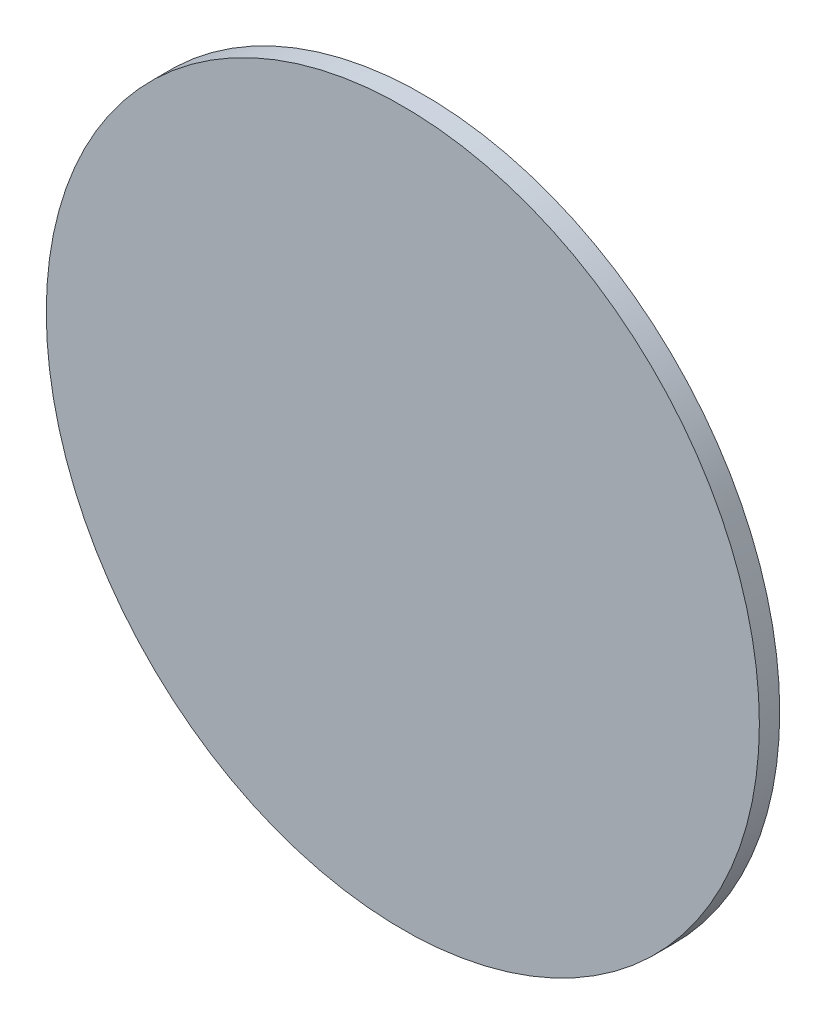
from build123d import *

# Parameters (mm, degrees)
ESQUISSE1_R      = 17.5
EXTRUSION1_DEPTH = 1


with BuildPart() as part:
    # Esquisse1 → Extrusion1 (new body)
    with BuildSketch(Plane.XY):
        Circle(ESQUISSE1_R)
    extrude(amount=EXTRUSION1_DEPTH)


solid = part.part
